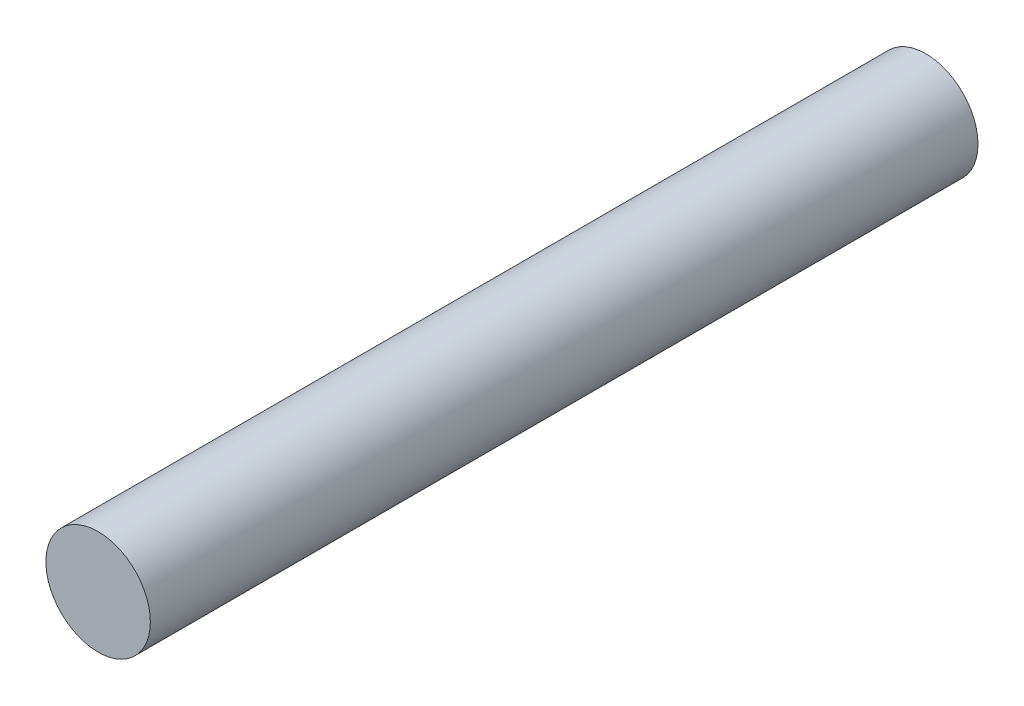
ISO-10303-21;
HEADER;
FILE_DESCRIPTION(('STEP AP214'),'2;1');
FILE_NAME('part.step','',(''),(''),'','','');
FILE_SCHEMA(('AUTOMOTIVE_DESIGN { 1 0 10303 214 1 1 1 1 }'));
ENDSEC;
DATA;
#1=APPLICATION_CONTEXT('core data for automotive mechanical design processes');
#2=APPLICATION_PROTOCOL_DEFINITION('international standard','automotive_design',2000,#1);
#3=PRODUCT_CONTEXT('',#1,'mechanical');
#4=PRODUCT('Part','Part','',(#3));
#5=PRODUCT_RELATED_PRODUCT_CATEGORY('part','',(#4));
#6=PRODUCT_DEFINITION_FORMATION('','',#4);
#7=PRODUCT_DEFINITION_CONTEXT('part definition',#1,'design');
#8=PRODUCT_DEFINITION('design','',#6,#7);
#9=PRODUCT_DEFINITION_SHAPE('','',#8);
#10=(LENGTH_UNIT() NAMED_UNIT(*) SI_UNIT(.MILLI.,.METRE.));
#11=(NAMED_UNIT(*) PLANE_ANGLE_UNIT() SI_UNIT($,.RADIAN.));
#12=(NAMED_UNIT(*) SI_UNIT($,.STERADIAN.) SOLID_ANGLE_UNIT());
#13=UNCERTAINTY_MEASURE_WITH_UNIT(LENGTH_MEASURE(1.E-05),#10,'distance_accuracy_value','');
#14=(GEOMETRIC_REPRESENTATION_CONTEXT(3) GLOBAL_UNCERTAINTY_ASSIGNED_CONTEXT((#13)) GLOBAL_UNIT_ASSIGNED_CONTEXT((#10,
#11,#12)) REPRESENTATION_CONTEXT('',''));
#15=CARTESIAN_POINT('',(0.,0.,0.));
#16=DIRECTION('',(0.,0.,1.));
#17=DIRECTION('',(1.,0.,0.));
#18=AXIS2_PLACEMENT_3D('',#15,#16,#17);
#19=CARTESIAN_POINT('',(0.,0.,15.85));
#20=DIRECTION('',(0.,0.,-1.));
#21=DIRECTION('',(-1.,0.,0.));
#22=AXIS2_PLACEMENT_3D('',#19,#20,#21);
#23=CYLINDRICAL_SURFACE('',#22,2.);
#24=CARTESIAN_POINT('',(0.,0.,15.85));
#25=DIRECTION('',(0.,0.,1.));
#26=DIRECTION('',(1.,0.,0.));
#27=AXIS2_PLACEMENT_3D('',#24,#25,#26);
#28=CIRCLE('',#27,2.);
#29=CARTESIAN_POINT('',(2.,0.,15.85));
#30=VERTEX_POINT('',#29);
#31=EDGE_CURVE('E10',#30,#30,#28,.T.);
#32=ORIENTED_EDGE('',*,*,#31,.F.);
#33=EDGE_LOOP('',(#32));
#34=FACE_BOUND('',#33,.T.);
#35=CARTESIAN_POINT('',(0.,0.,-15.85));
#36=DIRECTION('',(0.,0.,1.));
#37=DIRECTION('',(1.,0.,0.));
#38=AXIS2_PLACEMENT_3D('',#35,#36,#37);
#39=CIRCLE('',#38,2.);
#40=CARTESIAN_POINT('',(2.,0.,-15.85));
#41=VERTEX_POINT('',#40);
#42=EDGE_CURVE('E33',#41,#41,#39,.T.);
#43=ORIENTED_EDGE('',*,*,#42,.T.);
#44=EDGE_LOOP('',(#43));
#45=FACE_BOUND('',#44,.T.);
#46=ADVANCED_FACE('F30',(#34,#45),#23,.T.);
#47=CARTESIAN_POINT('',(0.,0.,15.85));
#48=DIRECTION('',(0.,0.,1.));
#49=DIRECTION('',(1.,0.,0.));
#50=AXIS2_PLACEMENT_3D('',#47,#48,#49);
#51=PLANE('',#50);
#52=ORIENTED_EDGE('',*,*,#31,.T.);
#53=EDGE_LOOP('',(#52));
#54=FACE_BOUND('',#53,.T.);
#55=ADVANCED_FACE('F45',(#54),#51,.T.);
#56=CARTESIAN_POINT('',(0.,0.,-15.85));
#57=DIRECTION('',(0.,0.,1.));
#58=DIRECTION('',(1.,0.,0.));
#59=AXIS2_PLACEMENT_3D('',#56,#57,#58);
#60=PLANE('',#59);
#61=ORIENTED_EDGE('',*,*,#42,.F.);
#62=EDGE_LOOP('',(#61));
#63=FACE_BOUND('',#62,.T.);
#64=ADVANCED_FACE('F43',(#63),#60,.F.);
#65=CLOSED_SHELL('',(#46,#55,#64));
#66=MANIFOLD_SOLID_BREP('B2',#65);
#67=ADVANCED_BREP_SHAPE_REPRESENTATION('',(#18,#66),#14);
#68=SHAPE_DEFINITION_REPRESENTATION(#9,#67);
ENDSEC;
END-ISO-10303-21;
